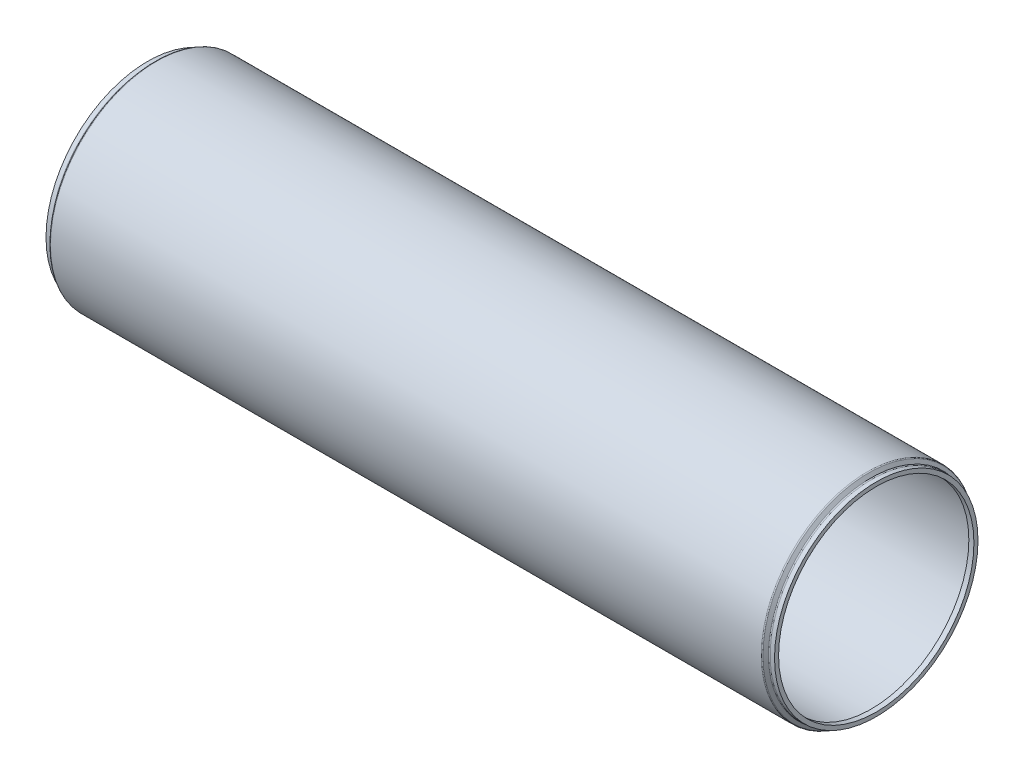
ISO-10303-21;
HEADER;
FILE_DESCRIPTION(('STEP AP214'),'2;1');
FILE_NAME('part.step','',(''),(''),'','','');
FILE_SCHEMA(('AUTOMOTIVE_DESIGN { 1 0 10303 214 1 1 1 1 }'));
ENDSEC;
DATA;
#1=APPLICATION_CONTEXT('core data for automotive mechanical design processes');
#2=APPLICATION_PROTOCOL_DEFINITION('international standard','automotive_design',2000,#1);
#3=PRODUCT_CONTEXT('',#1,'mechanical');
#4=PRODUCT('Part','Part','',(#3));
#5=PRODUCT_RELATED_PRODUCT_CATEGORY('part','',(#4));
#6=PRODUCT_DEFINITION_FORMATION('','',#4);
#7=PRODUCT_DEFINITION_CONTEXT('part definition',#1,'design');
#8=PRODUCT_DEFINITION('design','',#6,#7);
#9=PRODUCT_DEFINITION_SHAPE('','',#8);
#10=(LENGTH_UNIT() NAMED_UNIT(*) SI_UNIT(.MILLI.,.METRE.));
#11=(NAMED_UNIT(*) PLANE_ANGLE_UNIT() SI_UNIT($,.RADIAN.));
#12=(NAMED_UNIT(*) SI_UNIT($,.STERADIAN.) SOLID_ANGLE_UNIT());
#13=UNCERTAINTY_MEASURE_WITH_UNIT(LENGTH_MEASURE(1.E-05),#10,'distance_accuracy_value','');
#14=(GEOMETRIC_REPRESENTATION_CONTEXT(3) GLOBAL_UNCERTAINTY_ASSIGNED_CONTEXT((#13)) GLOBAL_UNIT_ASSIGNED_CONTEXT((#10,
#11,#12)) REPRESENTATION_CONTEXT('',''));
#15=CARTESIAN_POINT('',(0.,0.,0.));
#16=DIRECTION('',(0.,0.,1.));
#17=DIRECTION('',(1.,0.,0.));
#18=AXIS2_PLACEMENT_3D('',#15,#16,#17);
#19=CARTESIAN_POINT('',(133.35,0.,0.));
#20=DIRECTION('',(-1.,0.,0.));
#21=DIRECTION('',(0.,0.,1.));
#22=AXIS2_PLACEMENT_3D('',#19,#20,#21);
#23=CYLINDRICAL_SURFACE('',#22,19.8755);
#24=CARTESIAN_POINT('',(133.21691595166,0.,0.));
#25=DIRECTION('',(-1.,0.,0.));
#26=DIRECTION('',(0.,0.,1.));
#27=AXIS2_PLACEMENT_3D('',#24,#25,#26);
#28=CIRCLE('',#27,19.8755);
#29=CARTESIAN_POINT('',(133.21691595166,0.,19.8755));
#30=VERTEX_POINT('',#29);
#31=EDGE_CURVE('E11',#30,#30,#28,.T.);
#32=ORIENTED_EDGE('',*,*,#31,.T.);
#33=EDGE_LOOP('',(#32));
#34=FACE_BOUND('',#33,.T.);
#35=CARTESIAN_POINT('',(0.133084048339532,0.,0.));
#36=DIRECTION('',(-1.,0.,0.));
#37=DIRECTION('',(0.,0.,1.));
#38=AXIS2_PLACEMENT_3D('',#35,#36,#37);
#39=CIRCLE('',#38,19.8755);
#40=CARTESIAN_POINT('',(0.133084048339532,0.,19.8755));
#41=VERTEX_POINT('',#40);
#42=EDGE_CURVE('E49',#41,#41,#39,.F.);
#43=ORIENTED_EDGE('',*,*,#42,.T.);
#44=EDGE_LOOP('',(#43));
#45=FACE_BOUND('',#44,.T.);
#46=ADVANCED_FACE('F30',(#34,#45),#23,.T.);
#47=CARTESIAN_POINT('',(133.35,0.,0.));
#48=DIRECTION('',(-1.,0.,0.));
#49=DIRECTION('',(0.,0.,1.));
#50=AXIS2_PLACEMENT_3D('',#47,#48,#49);
#51=CYLINDRICAL_SURFACE('',#50,19.1135);
#52=CARTESIAN_POINT('',(133.35,0.,0.));
#53=DIRECTION('',(1.,0.,0.));
#54=DIRECTION('',(0.,0.,-1.));
#55=AXIS2_PLACEMENT_3D('',#52,#53,#54);
#56=CIRCLE('',#55,19.1135);
#57=CARTESIAN_POINT('',(133.35,0.,-19.1135));
#58=VERTEX_POINT('',#57);
#59=EDGE_CURVE('E76',#58,#58,#56,.T.);
#60=ORIENTED_EDGE('',*,*,#59,.T.);
#61=EDGE_LOOP('',(#60));
#62=FACE_BOUND('',#61,.T.);
#63=CARTESIAN_POINT('',(0.,0.,0.));
#64=DIRECTION('',(1.,0.,0.));
#65=DIRECTION('',(0.,0.,-1.));
#66=AXIS2_PLACEMENT_3D('',#63,#64,#65);
#67=CIRCLE('',#66,19.1135);
#68=CARTESIAN_POINT('',(0.,0.,-19.1135));
#69=VERTEX_POINT('',#68);
#70=EDGE_CURVE('E61',#69,#69,#67,.T.);
#71=ORIENTED_EDGE('',*,*,#70,.F.);
#72=EDGE_LOOP('',(#71));
#73=FACE_BOUND('',#72,.T.);
#74=ADVANCED_FACE('F107',(#62,#73),#51,.F.);
#75=CARTESIAN_POINT('',(133.35,0.,0.));
#76=DIRECTION('',(1.,0.,0.));
#77=DIRECTION('',(0.,0.,-1.));
#78=AXIS2_PLACEMENT_3D('',#75,#76,#77);
#79=CYLINDRICAL_SURFACE('',#78,18.288);
#80=CARTESIAN_POINT('',(-0.571500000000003,0.,0.));
#81=DIRECTION('',(1.,0.,0.));
#82=DIRECTION('',(0.,0.,-1.));
#83=AXIS2_PLACEMENT_3D('',#80,#81,#82);
#84=CIRCLE('',#83,18.288);
#85=CARTESIAN_POINT('',(-0.571500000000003,0.,-18.288));
#86=VERTEX_POINT('',#85);
#87=EDGE_CURVE('E64',#86,#86,#84,.T.);
#88=ORIENTED_EDGE('',*,*,#87,.T.);
#89=EDGE_LOOP('',(#88));
#90=FACE_BOUND('',#89,.T.);
#91=CARTESIAN_POINT('',(-1.524,0.,0.));
#92=DIRECTION('',(-1.,0.,0.));
#93=DIRECTION('',(0.,0.,1.));
#94=AXIS2_PLACEMENT_3D('',#91,#92,#93);
#95=CIRCLE('',#94,18.288);
#96=CARTESIAN_POINT('',(-1.524,0.,18.288));
#97=VERTEX_POINT('',#96);
#98=EDGE_CURVE('E70',#97,#97,#95,.T.);
#99=ORIENTED_EDGE('',*,*,#98,.T.);
#100=EDGE_LOOP('',(#99));
#101=FACE_BOUND('',#100,.T.);
#102=ADVANCED_FACE('F111',(#90,#101),#79,.F.);
#103=CARTESIAN_POINT('',(-0.571500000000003,0.,0.));
#104=DIRECTION('',(1.,0.,0.));
#105=DIRECTION('',(0.,0.,-1.));
#106=AXIS2_PLACEMENT_3D('',#103,#104,#105);
#107=CONICAL_SURFACE('',#106,18.288,0.965251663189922);
#108=ORIENTED_EDGE('',*,*,#70,.T.);
#109=EDGE_LOOP('',(#108));
#110=FACE_BOUND('',#109,.T.);
#111=ORIENTED_EDGE('',*,*,#87,.F.);
#112=EDGE_LOOP('',(#111));
#113=FACE_BOUND('',#112,.T.);
#114=ADVANCED_FACE('F135',(#110,#113),#107,.F.);
#115=CARTESIAN_POINT('',(0.,0.,0.));
#116=DIRECTION('',(1.,0.,0.));
#117=DIRECTION('',(0.,0.,-1.));
#118=AXIS2_PLACEMENT_3D('',#115,#116,#117);
#119=CONICAL_SURFACE('',#118,19.8755,0.965251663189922);
#120=CARTESIAN_POINT('',(-0.495747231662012,0.,0.));
#121=DIRECTION('',(1.,0.,0.));
#122=DIRECTION('',(0.,0.,-1.));
#123=AXIS2_PLACEMENT_3D('',#120,#121,#122);
#124=CIRCLE('',#123,19.1594206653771);
#125=CARTESIAN_POINT('',(-0.495747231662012,0.,-19.1594206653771));
#126=VERTEX_POINT('',#125);
#127=EDGE_CURVE('E55',#126,#126,#124,.T.);
#128=ORIENTED_EDGE('',*,*,#127,.T.);
#129=EDGE_LOOP('',(#128));
#130=FACE_BOUND('',#129,.T.);
#131=CARTESIAN_POINT('',(-0.0757527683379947,0.,0.));
#132=DIRECTION('',(1.,0.,0.));
#133=DIRECTION('',(0.,0.,-1.));
#134=AXIS2_PLACEMENT_3D('',#131,#132,#133);
#135=CIRCLE('',#134,19.7660793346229);
#136=CARTESIAN_POINT('',(-0.0757527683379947,0.,-19.7660793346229));
#137=VERTEX_POINT('',#136);
#138=EDGE_CURVE('E58',#137,#137,#135,.F.);
#139=ORIENTED_EDGE('',*,*,#138,.T.);
#140=EDGE_LOOP('',(#139));
#141=FACE_BOUND('',#140,.T.);
#142=ADVANCED_FACE('F131',(#130,#141),#119,.T.);
#143=CARTESIAN_POINT('',(133.35,0.,0.));
#144=DIRECTION('',(1.,0.,0.));
#145=DIRECTION('',(0.,0.,-1.));
#146=AXIS2_PLACEMENT_3D('',#143,#144,#145);
#147=CYLINDRICAL_SURFACE('',#146,19.05);
#148=CARTESIAN_POINT('',(-0.704584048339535,0.,0.));
#149=DIRECTION('',(1.,0.,0.));
#150=DIRECTION('',(0.,0.,-1.));
#151=AXIS2_PLACEMENT_3D('',#148,#149,#150);
#152=CIRCLE('',#151,19.05);
#153=CARTESIAN_POINT('',(-0.704584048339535,0.,-19.05));
#154=VERTEX_POINT('',#153);
#155=EDGE_CURVE('E52',#154,#154,#152,.F.);
#156=ORIENTED_EDGE('',*,*,#155,.T.);
#157=EDGE_LOOP('',(#156));
#158=FACE_BOUND('',#157,.T.);
#159=CARTESIAN_POINT('',(-1.524,0.,0.));
#160=DIRECTION('',(-1.,0.,0.));
#161=DIRECTION('',(0.,0.,1.));
#162=AXIS2_PLACEMENT_3D('',#159,#160,#161);
#163=CIRCLE('',#162,19.05);
#164=CARTESIAN_POINT('',(-1.524,0.,19.05));
#165=VERTEX_POINT('',#164);
#166=EDGE_CURVE('E67',#165,#165,#163,.T.);
#167=ORIENTED_EDGE('',*,*,#166,.F.);
#168=EDGE_LOOP('',(#167));
#169=FACE_BOUND('',#168,.T.);
#170=ADVANCED_FACE('F124',(#158,#169),#147,.T.);
#171=CARTESIAN_POINT('',(-0.704584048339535,0.,0.));
#172=DIRECTION('',(1.,0.,0.));
#173=DIRECTION('',(0.,0.,-1.));
#174=AXIS2_PLACEMENT_3D('',#171,#172,#173);
#175=TOROIDAL_SURFACE('',#174,19.304,0.254);
#176=ORIENTED_EDGE('',*,*,#155,.F.);
#177=EDGE_LOOP('',(#176));
#178=FACE_BOUND('',#177,.T.);
#179=ORIENTED_EDGE('',*,*,#127,.F.);
#180=EDGE_LOOP('',(#179));
#181=FACE_BOUND('',#180,.T.);
#182=ADVANCED_FACE('F117',(#178,#181),#175,.F.);
#183=CARTESIAN_POINT('',(0.133084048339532,0.,0.));
#184=DIRECTION('',(-1.,0.,0.));
#185=DIRECTION('',(0.,0.,1.));
#186=AXIS2_PLACEMENT_3D('',#183,#184,#185);
#187=TOROIDAL_SURFACE('',#186,19.6215,0.254);
#188=ORIENTED_EDGE('',*,*,#138,.F.);
#189=EDGE_LOOP('',(#188));
#190=FACE_BOUND('',#189,.T.);
#191=ORIENTED_EDGE('',*,*,#42,.F.);
#192=EDGE_LOOP('',(#191));
#193=FACE_BOUND('',#192,.T.);
#194=ADVANCED_FACE('F103',(#190,#193),#187,.T.);
#195=CARTESIAN_POINT('',(-1.524,0.,0.));
#196=DIRECTION('',(-1.,0.,0.));
#197=DIRECTION('',(0.,0.,1.));
#198=AXIS2_PLACEMENT_3D('',#195,#196,#197);
#199=PLANE('',#198);
#200=ORIENTED_EDGE('',*,*,#166,.T.);
#201=EDGE_LOOP('',(#200));
#202=FACE_BOUND('',#201,.T.);
#203=ORIENTED_EDGE('',*,*,#98,.F.);
#204=EDGE_LOOP('',(#203));
#205=FACE_BOUND('',#204,.T.);
#206=ADVANCED_FACE('F92',(#202,#205),#199,.T.);
#207=CARTESIAN_POINT('',(0.,0.,0.));
#208=DIRECTION('',(-1.,0.,0.));
#209=DIRECTION('',(0.,0.,-1.));
#210=AXIS2_PLACEMENT_3D('',#207,#208,#209);
#211=CYLINDRICAL_SURFACE('',#210,18.288);
#212=CARTESIAN_POINT('',(133.9215,0.,0.));
#213=DIRECTION('',(1.,0.,0.));
#214=DIRECTION('',(0.,0.,-1.));
#215=AXIS2_PLACEMENT_3D('',#212,#213,#214);
#216=CIRCLE('',#215,18.288);
#217=CARTESIAN_POINT('',(133.9215,0.,-18.288));
#218=VERTEX_POINT('',#217);
#219=EDGE_CURVE('E73',#218,#218,#216,.T.);
#220=ORIENTED_EDGE('',*,*,#219,.F.);
#221=EDGE_LOOP('',(#220));
#222=FACE_BOUND('',#221,.T.);
#223=CARTESIAN_POINT('',(134.874,0.,0.));
#224=DIRECTION('',(-1.,0.,0.));
#225=DIRECTION('',(0.,0.,1.));
#226=AXIS2_PLACEMENT_3D('',#223,#224,#225);
#227=CIRCLE('',#226,18.288);
#228=CARTESIAN_POINT('',(134.874,0.,18.288));
#229=VERTEX_POINT('',#228);
#230=EDGE_CURVE('E82',#229,#229,#227,.T.);
#231=ORIENTED_EDGE('',*,*,#230,.F.);
#232=EDGE_LOOP('',(#231));
#233=FACE_BOUND('',#232,.T.);
#234=ADVANCED_FACE('F89',(#222,#233),#211,.F.);
#235=CARTESIAN_POINT('',(133.9215,0.,0.));
#236=DIRECTION('',(-1.,0.,0.));
#237=DIRECTION('',(0.,0.,-1.));
#238=AXIS2_PLACEMENT_3D('',#235,#236,#237);
#239=CONICAL_SURFACE('',#238,18.288,0.965251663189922);
#240=ORIENTED_EDGE('',*,*,#59,.F.);
#241=EDGE_LOOP('',(#240));
#242=FACE_BOUND('',#241,.T.);
#243=ORIENTED_EDGE('',*,*,#219,.T.);
#244=EDGE_LOOP('',(#243));
#245=FACE_BOUND('',#244,.T.);
#246=ADVANCED_FACE('F91',(#242,#245),#239,.F.);
#247=CARTESIAN_POINT('',(133.35,0.,0.));
#248=DIRECTION('',(-1.,0.,0.));
#249=DIRECTION('',(0.,0.,-1.));
#250=AXIS2_PLACEMENT_3D('',#247,#248,#249);
#251=CONICAL_SURFACE('',#250,19.8755,0.965251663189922);
#252=CARTESIAN_POINT('',(133.845747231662,0.,0.));
#253=DIRECTION('',(-1.,0.,0.));
#254=DIRECTION('',(0.,0.,1.));
#255=AXIS2_PLACEMENT_3D('',#252,#253,#254);
#256=CIRCLE('',#255,19.1594206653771);
#257=CARTESIAN_POINT('',(133.845747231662,0.,19.1594206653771));
#258=VERTEX_POINT('',#257);
#259=EDGE_CURVE('E36',#258,#258,#256,.T.);
#260=ORIENTED_EDGE('',*,*,#259,.T.);
#261=EDGE_LOOP('',(#260));
#262=FACE_BOUND('',#261,.T.);
#263=CARTESIAN_POINT('',(133.425752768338,0.,0.));
#264=DIRECTION('',(-1.,0.,0.));
#265=DIRECTION('',(0.,0.,1.));
#266=AXIS2_PLACEMENT_3D('',#263,#264,#265);
#267=CIRCLE('',#266,19.7660793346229);
#268=CARTESIAN_POINT('',(133.425752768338,0.,19.7660793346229));
#269=VERTEX_POINT('',#268);
#270=EDGE_CURVE('E40',#269,#269,#267,.F.);
#271=ORIENTED_EDGE('',*,*,#270,.T.);
#272=EDGE_LOOP('',(#271));
#273=FACE_BOUND('',#272,.T.);
#274=ADVANCED_FACE('F99',(#262,#273),#251,.T.);
#275=CARTESIAN_POINT('',(0.,0.,0.));
#276=DIRECTION('',(-1.,0.,0.));
#277=DIRECTION('',(0.,0.,-1.));
#278=AXIS2_PLACEMENT_3D('',#275,#276,#277);
#279=CYLINDRICAL_SURFACE('',#278,19.05);
#280=CARTESIAN_POINT('',(134.05458404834,0.,0.));
#281=DIRECTION('',(1.,0.,0.));
#282=DIRECTION('',(0.,0.,-1.));
#283=AXIS2_PLACEMENT_3D('',#280,#281,#282);
#284=CIRCLE('',#283,19.05);
#285=CARTESIAN_POINT('',(134.05458404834,0.,-19.05));
#286=VERTEX_POINT('',#285);
#287=EDGE_CURVE('E44',#286,#286,#284,.T.);
#288=ORIENTED_EDGE('',*,*,#287,.T.);
#289=EDGE_LOOP('',(#288));
#290=FACE_BOUND('',#289,.T.);
#291=CARTESIAN_POINT('',(134.874,0.,0.));
#292=DIRECTION('',(-1.,0.,0.));
#293=DIRECTION('',(0.,0.,1.));
#294=AXIS2_PLACEMENT_3D('',#291,#292,#293);
#295=CIRCLE('',#294,19.05);
#296=CARTESIAN_POINT('',(134.874,0.,19.05));
#297=VERTEX_POINT('',#296);
#298=EDGE_CURVE('E79',#297,#297,#295,.T.);
#299=ORIENTED_EDGE('',*,*,#298,.T.);
#300=EDGE_LOOP('',(#299));
#301=FACE_BOUND('',#300,.T.);
#302=ADVANCED_FACE('F176',(#290,#301),#279,.T.);
#303=CARTESIAN_POINT('',(134.05458404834,0.,0.));
#304=DIRECTION('',(1.,0.,0.));
#305=DIRECTION('',(0.,0.,-1.));
#306=AXIS2_PLACEMENT_3D('',#303,#304,#305);
#307=TOROIDAL_SURFACE('',#306,19.304,0.254);
#308=ORIENTED_EDGE('',*,*,#259,.F.);
#309=EDGE_LOOP('',(#308));
#310=FACE_BOUND('',#309,.T.);
#311=ORIENTED_EDGE('',*,*,#287,.F.);
#312=EDGE_LOOP('',(#311));
#313=FACE_BOUND('',#312,.T.);
#314=ADVANCED_FACE('F183',(#310,#313),#307,.F.);
#315=CARTESIAN_POINT('',(133.21691595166,0.,0.));
#316=DIRECTION('',(-1.,0.,0.));
#317=DIRECTION('',(0.,0.,1.));
#318=AXIS2_PLACEMENT_3D('',#315,#316,#317);
#319=TOROIDAL_SURFACE('',#318,19.6215,0.254);
#320=ORIENTED_EDGE('',*,*,#31,.F.);
#321=EDGE_LOOP('',(#320));
#322=FACE_BOUND('',#321,.T.);
#323=ORIENTED_EDGE('',*,*,#270,.F.);
#324=EDGE_LOOP('',(#323));
#325=FACE_BOUND('',#324,.T.);
#326=ADVANCED_FACE('F192',(#322,#325),#319,.T.);
#327=CARTESIAN_POINT('',(134.874,0.,0.));
#328=DIRECTION('',(1.,0.,0.));
#329=DIRECTION('',(0.,0.,1.));
#330=AXIS2_PLACEMENT_3D('',#327,#328,#329);
#331=PLANE('',#330);
#332=ORIENTED_EDGE('',*,*,#230,.T.);
#333=EDGE_LOOP('',(#332));
#334=FACE_BOUND('',#333,.T.);
#335=ORIENTED_EDGE('',*,*,#298,.F.);
#336=EDGE_LOOP('',(#335));
#337=FACE_BOUND('',#336,.T.);
#338=ADVANCED_FACE('F86',(#334,#337),#331,.T.);
#339=CLOSED_SHELL('',(#46,#74,#102,#114,#142,#170,#182,#194,#206,#234,#246,#274,#302,#314,#326,#338));
#340=MANIFOLD_SOLID_BREP('B2',#339);
#341=ADVANCED_BREP_SHAPE_REPRESENTATION('',(#18,#340),#14);
#342=SHAPE_DEFINITION_REPRESENTATION(#9,#341);
ENDSEC;
END-ISO-10303-21;
